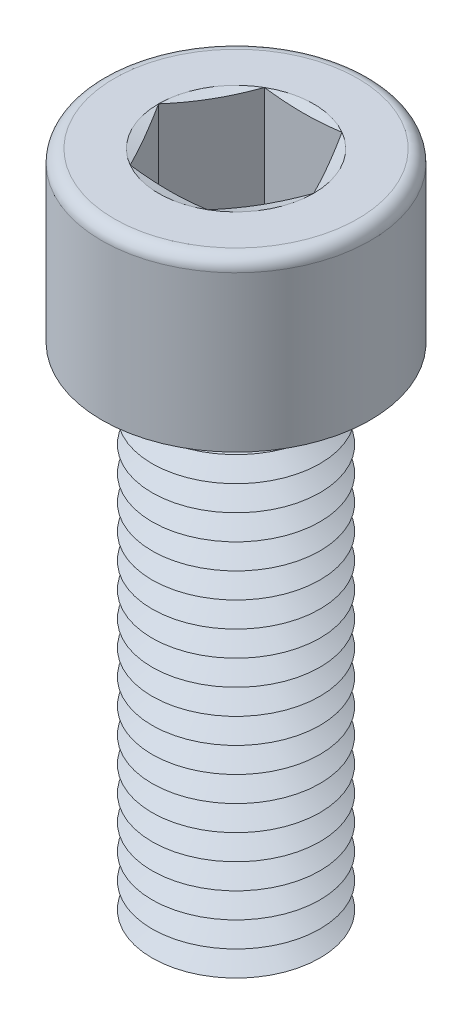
from build123d import *

# Parameters (mm, degrees)
SKETCH1_R       = 5
EXTRUDE1_DEPTH  = 30
SKETCH2_R       = 8
EXTRUDE2_DEPTH  = 10
EXTRUDE3_DEPTH  = 8
FILLET1_R       = 0.75
LPATTERN1_COUNT = 20
LPATTERN1_PITCH = 1.5


with BuildPart() as part:
    # Sketch1 → Extrude1 (new body)
    with BuildSketch(Plane(origin=(0, 0, 0), x_dir=(1, 0, 0), z_dir=(0, 1, 0))):
        with Locations(Location((0, 0, 0), (0, 0, 270))):
            Circle(SKETCH1_R)
    extrude(amount=EXTRUDE1_DEPTH)

    # Sketch2 → Extrude2 (add)
    with BuildSketch(Plane(origin=(0, 30, 0), x_dir=(1, 0, 0), z_dir=(0, 1, 0))):
        with Locations(Location((0, 0, 0), (0, 0, 270))):
            Circle(SKETCH2_R)
    extrude(amount=EXTRUDE2_DEPTH)

    # Sketch3 → Extrude3 (cut)
    with BuildSketch(Plane(origin=(0, 40, 0), x_dir=(1, 0, 0), z_dir=(0, 1, 0))):
        Polygon((2.309401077, 4), (-2.309401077, 4), (-4.618802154, 0), (-2.309401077, -4), (2.309401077, -4), (4.618802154, 0), align=None)
    extrude(amount=-EXTRUDE3_DEPTH, mode=Mode.SUBTRACT)

    # Fillet1
    fillet1_edges = [part.edges().sort_by_distance(p)[0] for p in [
        (0, 40, -8),
    ]]
    fillet(fillet1_edges, radius=FILLET1_R)

    # Sketch4 → Cut-Revolve1 (revolve, cut)
    with BuildSketch(Plane(origin=(0, 0, 0), x_dir=(0, 0, -1), z_dir=(1, 0, 0))):
        Polygon((-4, 32), (0, 32), (0, 29.690598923), align=None)
    revolve(axis=Axis((0, 32, 0), (0, -1, 0)), mode=Mode.SUBTRACT)

    # Sketch5 → Cut-Revolve2 (revolve, cut)
    with BuildSketch(Plane.XY, mode=Mode.PRIVATE) as cut_revolve2_sk:
        Polygon((-5, 0.75), (-5, -0.75), (-3.700961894, 0), align=None)
    cut_revolve2 = revolve(cut_revolve2_sk.sketch.rotate(Axis((0, 30, 0), (0, -1, 0)), 270), axis=Axis((0, 30, 0), (0, -1, 0)), mode=Mode.SUBTRACT)

    # LPattern1: Cut-Revolve2 ×20
    with Locations(*[(0, i * LPATTERN1_PITCH, 0) for i in range(1, LPATTERN1_COUNT)]):
        add(cut_revolve2, mode=Mode.SUBTRACT)

    # Extrude4 cone 1 section (on through the dimple's axis) → Extrude4 (revolve, cut)
    with BuildSketch(Plane(origin=(0, 40, 0), x_dir=(0, 0, 1), z_dir=(1, 0, 0))):
        Polygon((0, 0), (4.618802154, 0), (0, 1.237604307), align=None)
    revolve(axis=Axis((0, 40, 0), (0, -1, 0)), mode=Mode.SUBTRACT)


solid = part.part
